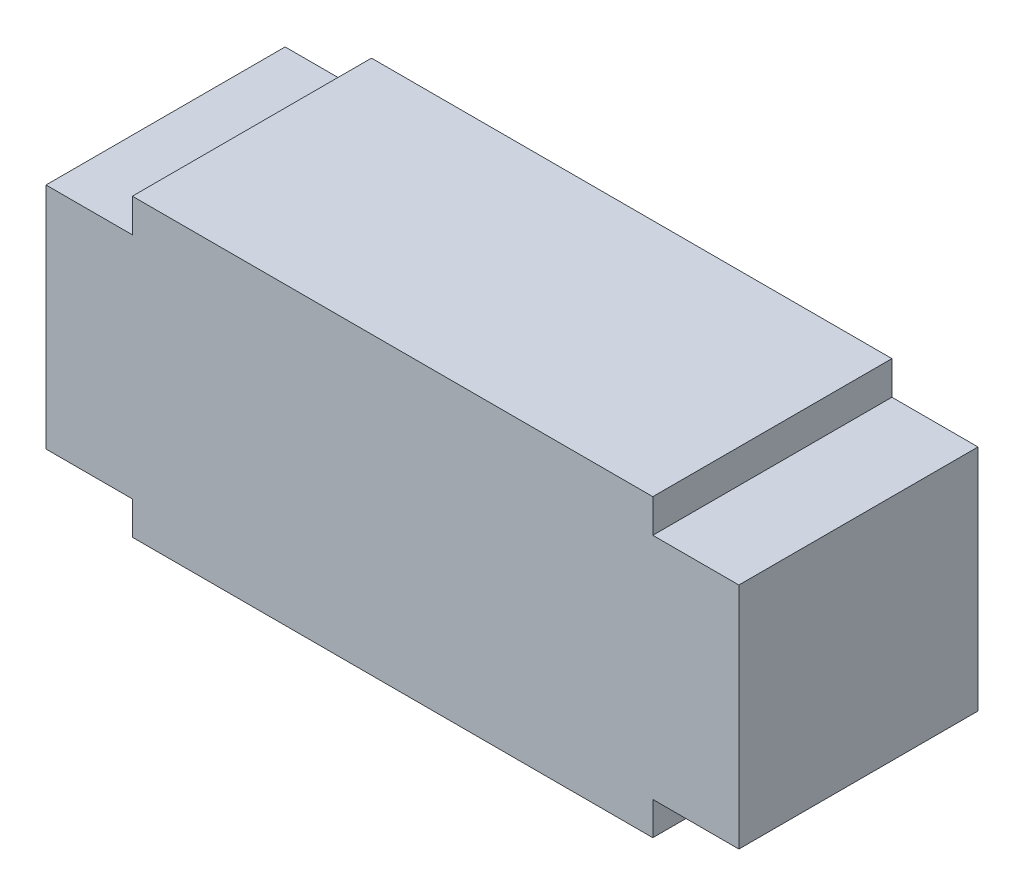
ISO-10303-21;
HEADER;
FILE_DESCRIPTION(('STEP AP214'),'2;1');
FILE_NAME('part.step','',(''),(''),'','','');
FILE_SCHEMA(('AUTOMOTIVE_DESIGN { 1 0 10303 214 1 1 1 1 }'));
ENDSEC;
DATA;
#1=APPLICATION_CONTEXT('core data for automotive mechanical design processes');
#2=APPLICATION_PROTOCOL_DEFINITION('international standard','automotive_design',2000,#1);
#3=PRODUCT_CONTEXT('',#1,'mechanical');
#4=PRODUCT('Part','Part','',(#3));
#5=PRODUCT_RELATED_PRODUCT_CATEGORY('part','',(#4));
#6=PRODUCT_DEFINITION_FORMATION('','',#4);
#7=PRODUCT_DEFINITION_CONTEXT('part definition',#1,'design');
#8=PRODUCT_DEFINITION('design','',#6,#7);
#9=PRODUCT_DEFINITION_SHAPE('','',#8);
#10=(LENGTH_UNIT() NAMED_UNIT(*) SI_UNIT(.MILLI.,.METRE.));
#11=(NAMED_UNIT(*) PLANE_ANGLE_UNIT() SI_UNIT($,.RADIAN.));
#12=(NAMED_UNIT(*) SI_UNIT($,.STERADIAN.) SOLID_ANGLE_UNIT());
#13=UNCERTAINTY_MEASURE_WITH_UNIT(LENGTH_MEASURE(1.E-05),#10,'distance_accuracy_value','');
#14=(GEOMETRIC_REPRESENTATION_CONTEXT(3) GLOBAL_UNCERTAINTY_ASSIGNED_CONTEXT((#13)) GLOBAL_UNIT_ASSIGNED_CONTEXT((#10,
#11,#12)) REPRESENTATION_CONTEXT('',''));
#15=CARTESIAN_POINT('',(0.,0.,0.));
#16=DIRECTION('',(0.,0.,1.));
#17=DIRECTION('',(1.,0.,0.));
#18=AXIS2_PLACEMENT_3D('',#15,#16,#17);
#19=CARTESIAN_POINT('',(0.,0.,0.849999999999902));
#20=DIRECTION('',(0.,0.,1.));
#21=DIRECTION('',(1.,0.,0.));
#22=AXIS2_PLACEMENT_3D('',#19,#20,#21);
#23=PLANE('',#22);
#24=DIRECTION('',(0.,1.,0.));
#25=VECTOR('',#24,1.);
#26=CARTESIAN_POINT('',(-0.92500000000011,0.,0.849999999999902));
#27=LINE('',#26,#25);
#28=CARTESIAN_POINT('',(-0.92500000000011,-0.406999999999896,0.849999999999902));
#29=VERTEX_POINT('',#28);
#30=CARTESIAN_POINT('',(-0.92500000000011,-0.524999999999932,0.849999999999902));
#31=VERTEX_POINT('',#30);
#32=EDGE_CURVE('E128',#29,#31,#27,.F.);
#33=ORIENTED_EDGE('',*,*,#32,.T.);
#34=DIRECTION('',(1.,0.,0.));
#35=VECTOR('',#34,1.);
#36=CARTESIAN_POINT('',(-0.92500000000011,-0.524999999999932,0.849999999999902));
#37=LINE('',#36,#35);
#38=CARTESIAN_POINT('',(0.92500000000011,-0.524999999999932,0.849999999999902));
#39=VERTEX_POINT('',#38);
#40=EDGE_CURVE('E130',#39,#31,#37,.F.);
#41=ORIENTED_EDGE('',*,*,#40,.F.);
#42=DIRECTION('',(0.,1.,0.));
#43=VECTOR('',#42,1.);
#44=CARTESIAN_POINT('',(0.92500000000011,-0.524999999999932,0.849999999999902));
#45=LINE('',#44,#43);
#46=CARTESIAN_POINT('',(0.92500000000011,-0.406999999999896,0.849999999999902));
#47=VERTEX_POINT('',#46);
#48=EDGE_CURVE('E133',#47,#39,#45,.F.);
#49=ORIENTED_EDGE('',*,*,#48,.F.);
#50=DIRECTION('',(1.,0.,0.));
#51=VECTOR('',#50,1.);
#52=CARTESIAN_POINT('',(0.92500000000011,-0.406999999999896,0.849999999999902));
#53=LINE('',#52,#51);
#54=CARTESIAN_POINT('',(1.2309999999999,-0.406999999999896,0.849999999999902));
#55=VERTEX_POINT('',#54);
#56=EDGE_CURVE('E137',#55,#47,#53,.F.);
#57=ORIENTED_EDGE('',*,*,#56,.F.);
#58=DIRECTION('',(0.,1.,0.));
#59=VECTOR('',#58,1.);
#60=CARTESIAN_POINT('',(1.2309999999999,-0.406999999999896,0.849999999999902));
#61=LINE('',#60,#59);
#62=CARTESIAN_POINT('',(1.2309999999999,0.4059999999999,0.849999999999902));
#63=VERTEX_POINT('',#62);
#64=EDGE_CURVE('E141',#63,#55,#61,.F.);
#65=ORIENTED_EDGE('',*,*,#64,.F.);
#66=DIRECTION('',(1.,0.,0.));
#67=VECTOR('',#66,1.);
#68=CARTESIAN_POINT('',(1.2309999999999,0.4059999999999,0.849999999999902));
#69=LINE('',#68,#67);
#70=CARTESIAN_POINT('',(0.92500000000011,0.4059999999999,0.849999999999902));
#71=VERTEX_POINT('',#70);
#72=EDGE_CURVE('E145',#71,#63,#69,.T.);
#73=ORIENTED_EDGE('',*,*,#72,.F.);
#74=DIRECTION('',(0.,1.,0.));
#75=VECTOR('',#74,1.);
#76=CARTESIAN_POINT('',(0.92500000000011,0.4059999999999,0.849999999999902));
#77=LINE('',#76,#75);
#78=CARTESIAN_POINT('',(0.92500000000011,0.524999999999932,0.849999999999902));
#79=VERTEX_POINT('',#78);
#80=EDGE_CURVE('E149',#79,#71,#77,.F.);
#81=ORIENTED_EDGE('',*,*,#80,.F.);
#82=DIRECTION('',(1.,0.,0.));
#83=VECTOR('',#82,1.);
#84=CARTESIAN_POINT('',(0.92500000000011,0.524999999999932,0.849999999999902));
#85=LINE('',#84,#83);
#86=CARTESIAN_POINT('',(-0.92500000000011,0.524999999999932,0.849999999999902));
#87=VERTEX_POINT('',#86);
#88=EDGE_CURVE('E107',#87,#79,#85,.T.);
#89=ORIENTED_EDGE('',*,*,#88,.F.);
#90=DIRECTION('',(0.,1.,0.));
#91=VECTOR('',#90,1.);
#92=CARTESIAN_POINT('',(-0.92500000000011,0.,0.849999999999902));
#93=LINE('',#92,#91);
#94=CARTESIAN_POINT('',(-0.92500000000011,0.4059999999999,0.849999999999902));
#95=VERTEX_POINT('',#94);
#96=EDGE_CURVE('E19',#87,#95,#93,.F.);
#97=ORIENTED_EDGE('',*,*,#96,.T.);
#98=DIRECTION('',(1.,0.,0.));
#99=VECTOR('',#98,1.);
#100=CARTESIAN_POINT('',(0.,0.4059999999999,0.849999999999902));
#101=LINE('',#100,#99);
#102=CARTESIAN_POINT('',(-1.2319999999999,0.4059999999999,0.849999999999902));
#103=VERTEX_POINT('',#102);
#104=EDGE_CURVE('E102',#95,#103,#101,.F.);
#105=ORIENTED_EDGE('',*,*,#104,.T.);
#106=DIRECTION('',(0.,1.,0.));
#107=VECTOR('',#106,1.);
#108=CARTESIAN_POINT('',(-1.2319999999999,0.,0.849999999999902));
#109=LINE('',#108,#107);
#110=CARTESIAN_POINT('',(-1.2319999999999,-0.406999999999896,0.849999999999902));
#111=VERTEX_POINT('',#110);
#112=EDGE_CURVE('E123',#103,#111,#109,.F.);
#113=ORIENTED_EDGE('',*,*,#112,.T.);
#114=DIRECTION('',(1.,0.,0.));
#115=VECTOR('',#114,1.);
#116=CARTESIAN_POINT('',(0.,-0.406999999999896,0.849999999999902));
#117=LINE('',#116,#115);
#118=EDGE_CURVE('E124',#111,#29,#117,.T.);
#119=ORIENTED_EDGE('',*,*,#118,.T.);
#120=EDGE_LOOP('',(#33,#41,#49,#57,#65,#73,#81,#89,#97,#105,#113,#119));
#121=FACE_BOUND('',#120,.T.);
#122=ADVANCED_FACE('F16',(#121),#23,.T.);
#123=CARTESIAN_POINT('',(-0.92500000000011,-0.524999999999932,0.));
#124=DIRECTION('',(0.,-1.,0.));
#125=DIRECTION('',(0.,0.,-1.));
#126=AXIS2_PLACEMENT_3D('',#123,#124,#125);
#127=PLANE('',#126);
#128=DIRECTION('',(0.,0.,1.));
#129=VECTOR('',#128,1.);
#130=CARTESIAN_POINT('',(-0.92500000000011,-0.524999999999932,0.));
#131=LINE('',#130,#129);
#132=CARTESIAN_POINT('',(-0.92500000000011,-0.524999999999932,0.));
#133=VERTEX_POINT('',#132);
#134=EDGE_CURVE('E160',#133,#31,#131,.T.);
#135=ORIENTED_EDGE('',*,*,#134,.F.);
#136=DIRECTION('',(1.,0.,0.));
#137=VECTOR('',#136,1.);
#138=CARTESIAN_POINT('',(0.,-0.524999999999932,0.));
#139=LINE('',#138,#137);
#140=CARTESIAN_POINT('',(0.92500000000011,-0.524999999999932,0.));
#141=VERTEX_POINT('',#140);
#142=EDGE_CURVE('E164',#133,#141,#139,.T.);
#143=ORIENTED_EDGE('',*,*,#142,.T.);
#144=DIRECTION('',(0.,0.,-1.));
#145=VECTOR('',#144,1.);
#146=CARTESIAN_POINT('',(0.92500000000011,-0.524999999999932,0.));
#147=LINE('',#146,#145);
#148=EDGE_CURVE('E135',#39,#141,#147,.T.);
#149=ORIENTED_EDGE('',*,*,#148,.F.);
#150=ORIENTED_EDGE('',*,*,#40,.T.);
#151=EDGE_LOOP('',(#135,#143,#149,#150));
#152=FACE_BOUND('',#151,.T.);
#153=ADVANCED_FACE('F207',(#152),#127,.T.);
#154=CARTESIAN_POINT('',(0.92500000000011,-0.524999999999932,0.));
#155=DIRECTION('',(1.,0.,0.));
#156=DIRECTION('',(0.,0.,-1.));
#157=AXIS2_PLACEMENT_3D('',#154,#155,#156);
#158=PLANE('',#157);
#159=ORIENTED_EDGE('',*,*,#148,.T.);
#160=DIRECTION('',(0.,1.,0.));
#161=VECTOR('',#160,1.);
#162=CARTESIAN_POINT('',(0.92500000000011,0.,0.));
#163=LINE('',#162,#161);
#164=CARTESIAN_POINT('',(0.92500000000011,-0.406999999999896,0.));
#165=VERTEX_POINT('',#164);
#166=EDGE_CURVE('E167',#141,#165,#163,.T.);
#167=ORIENTED_EDGE('',*,*,#166,.T.);
#168=DIRECTION('',(0.,0.,-1.));
#169=VECTOR('',#168,1.);
#170=CARTESIAN_POINT('',(0.92500000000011,-0.406999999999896,0.));
#171=LINE('',#170,#169);
#172=EDGE_CURVE('E139',#47,#165,#171,.T.);
#173=ORIENTED_EDGE('',*,*,#172,.F.);
#174=ORIENTED_EDGE('',*,*,#48,.T.);
#175=EDGE_LOOP('',(#159,#167,#173,#174));
#176=FACE_BOUND('',#175,.T.);
#177=ADVANCED_FACE('F244',(#176),#158,.T.);
#178=CARTESIAN_POINT('',(0.92500000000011,-0.406999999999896,0.));
#179=DIRECTION('',(0.,-1.,0.));
#180=DIRECTION('',(0.,0.,-1.));
#181=AXIS2_PLACEMENT_3D('',#178,#179,#180);
#182=PLANE('',#181);
#183=ORIENTED_EDGE('',*,*,#172,.T.);
#184=DIRECTION('',(1.,0.,0.));
#185=VECTOR('',#184,1.);
#186=CARTESIAN_POINT('',(0.,-0.406999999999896,0.));
#187=LINE('',#186,#185);
#188=CARTESIAN_POINT('',(1.2309999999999,-0.406999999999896,0.));
#189=VERTEX_POINT('',#188);
#190=EDGE_CURVE('E170',#165,#189,#187,.T.);
#191=ORIENTED_EDGE('',*,*,#190,.T.);
#192=DIRECTION('',(0.,0.,-1.));
#193=VECTOR('',#192,1.);
#194=CARTESIAN_POINT('',(1.2309999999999,-0.406999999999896,0.));
#195=LINE('',#194,#193);
#196=EDGE_CURVE('E143',#55,#189,#195,.T.);
#197=ORIENTED_EDGE('',*,*,#196,.F.);
#198=ORIENTED_EDGE('',*,*,#56,.T.);
#199=EDGE_LOOP('',(#183,#191,#197,#198));
#200=FACE_BOUND('',#199,.T.);
#201=ADVANCED_FACE('F240',(#200),#182,.T.);
#202=CARTESIAN_POINT('',(1.2309999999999,-0.406999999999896,0.));
#203=DIRECTION('',(1.,0.,0.));
#204=DIRECTION('',(0.,0.,-1.));
#205=AXIS2_PLACEMENT_3D('',#202,#203,#204);
#206=PLANE('',#205);
#207=ORIENTED_EDGE('',*,*,#196,.T.);
#208=DIRECTION('',(0.,1.,0.));
#209=VECTOR('',#208,1.);
#210=CARTESIAN_POINT('',(1.2309999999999,0.,0.));
#211=LINE('',#210,#209);
#212=CARTESIAN_POINT('',(1.2309999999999,0.4059999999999,0.));
#213=VERTEX_POINT('',#212);
#214=EDGE_CURVE('E173',#189,#213,#211,.T.);
#215=ORIENTED_EDGE('',*,*,#214,.T.);
#216=DIRECTION('',(0.,0.,1.));
#217=VECTOR('',#216,1.);
#218=CARTESIAN_POINT('',(1.2309999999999,0.4059999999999,0.));
#219=LINE('',#218,#217);
#220=EDGE_CURVE('E147',#63,#213,#219,.F.);
#221=ORIENTED_EDGE('',*,*,#220,.F.);
#222=ORIENTED_EDGE('',*,*,#64,.T.);
#223=EDGE_LOOP('',(#207,#215,#221,#222));
#224=FACE_BOUND('',#223,.T.);
#225=ADVANCED_FACE('F236',(#224),#206,.T.);
#226=CARTESIAN_POINT('',(1.2309999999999,0.4059999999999,0.));
#227=DIRECTION('',(0.,1.,0.));
#228=DIRECTION('',(0.,0.,1.));
#229=AXIS2_PLACEMENT_3D('',#226,#227,#228);
#230=PLANE('',#229);
#231=ORIENTED_EDGE('',*,*,#220,.T.);
#232=DIRECTION('',(1.,0.,0.));
#233=VECTOR('',#232,1.);
#234=CARTESIAN_POINT('',(0.,0.4059999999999,0.));
#235=LINE('',#234,#233);
#236=CARTESIAN_POINT('',(0.92500000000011,0.4059999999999,0.));
#237=VERTEX_POINT('',#236);
#238=EDGE_CURVE('E176',#213,#237,#235,.F.);
#239=ORIENTED_EDGE('',*,*,#238,.T.);
#240=DIRECTION('',(0.,0.,-1.));
#241=VECTOR('',#240,1.);
#242=CARTESIAN_POINT('',(0.92500000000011,0.4059999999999,0.));
#243=LINE('',#242,#241);
#244=EDGE_CURVE('E151',#71,#237,#243,.T.);
#245=ORIENTED_EDGE('',*,*,#244,.F.);
#246=ORIENTED_EDGE('',*,*,#72,.T.);
#247=EDGE_LOOP('',(#231,#239,#245,#246));
#248=FACE_BOUND('',#247,.T.);
#249=ADVANCED_FACE('F232',(#248),#230,.T.);
#250=CARTESIAN_POINT('',(0.92500000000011,0.4059999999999,0.));
#251=DIRECTION('',(1.,0.,0.));
#252=DIRECTION('',(0.,0.,-1.));
#253=AXIS2_PLACEMENT_3D('',#250,#251,#252);
#254=PLANE('',#253);
#255=ORIENTED_EDGE('',*,*,#244,.T.);
#256=DIRECTION('',(0.,1.,0.));
#257=VECTOR('',#256,1.);
#258=CARTESIAN_POINT('',(0.92500000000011,0.,0.));
#259=LINE('',#258,#257);
#260=CARTESIAN_POINT('',(0.92500000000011,0.524999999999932,0.));
#261=VERTEX_POINT('',#260);
#262=EDGE_CURVE('E179',#237,#261,#259,.T.);
#263=ORIENTED_EDGE('',*,*,#262,.T.);
#264=DIRECTION('',(0.,0.,1.));
#265=VECTOR('',#264,1.);
#266=CARTESIAN_POINT('',(0.92500000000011,0.524999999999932,0.));
#267=LINE('',#266,#265);
#268=EDGE_CURVE('E154',#79,#261,#267,.F.);
#269=ORIENTED_EDGE('',*,*,#268,.F.);
#270=ORIENTED_EDGE('',*,*,#80,.T.);
#271=EDGE_LOOP('',(#255,#263,#269,#270));
#272=FACE_BOUND('',#271,.T.);
#273=ADVANCED_FACE('F228',(#272),#254,.T.);
#274=CARTESIAN_POINT('',(0.92500000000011,0.524999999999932,0.));
#275=DIRECTION('',(0.,1.,0.));
#276=DIRECTION('',(0.,0.,1.));
#277=AXIS2_PLACEMENT_3D('',#274,#275,#276);
#278=PLANE('',#277);
#279=ORIENTED_EDGE('',*,*,#268,.T.);
#280=DIRECTION('',(1.,0.,0.));
#281=VECTOR('',#280,1.);
#282=CARTESIAN_POINT('',(0.,0.524999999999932,0.));
#283=LINE('',#282,#281);
#284=CARTESIAN_POINT('',(-0.92500000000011,0.524999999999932,0.));
#285=VERTEX_POINT('',#284);
#286=EDGE_CURVE('E182',#261,#285,#283,.F.);
#287=ORIENTED_EDGE('',*,*,#286,.T.);
#288=DIRECTION('',(0.,0.,1.));
#289=VECTOR('',#288,1.);
#290=CARTESIAN_POINT('',(-0.92500000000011,0.524999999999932,0.));
#291=LINE('',#290,#289);
#292=EDGE_CURVE('E119',#87,#285,#291,.F.);
#293=ORIENTED_EDGE('',*,*,#292,.F.);
#294=ORIENTED_EDGE('',*,*,#88,.T.);
#295=EDGE_LOOP('',(#279,#287,#293,#294));
#296=FACE_BOUND('',#295,.T.);
#297=ADVANCED_FACE('F225',(#296),#278,.T.);
#298=CARTESIAN_POINT('',(-0.92500000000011,0.524999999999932,0.));
#299=DIRECTION('',(-1.,0.,0.));
#300=DIRECTION('',(0.,0.,1.));
#301=AXIS2_PLACEMENT_3D('',#298,#299,#300);
#302=PLANE('',#301);
#303=ORIENTED_EDGE('',*,*,#292,.T.);
#304=DIRECTION('',(0.,1.,0.));
#305=VECTOR('',#304,1.);
#306=CARTESIAN_POINT('',(-0.92500000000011,0.,0.));
#307=LINE('',#306,#305);
#308=CARTESIAN_POINT('',(-0.92500000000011,0.4059999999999,0.));
#309=VERTEX_POINT('',#308);
#310=EDGE_CURVE('E114',#285,#309,#307,.F.);
#311=ORIENTED_EDGE('',*,*,#310,.T.);
#312=DIRECTION('',(0.,0.,1.));
#313=VECTOR('',#312,1.);
#314=CARTESIAN_POINT('',(-0.92500000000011,0.4059999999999,0.));
#315=LINE('',#314,#313);
#316=EDGE_CURVE('E111',#95,#309,#315,.F.);
#317=ORIENTED_EDGE('',*,*,#316,.F.);
#318=ORIENTED_EDGE('',*,*,#96,.F.);
#319=EDGE_LOOP('',(#303,#311,#317,#318));
#320=FACE_BOUND('',#319,.T.);
#321=ADVANCED_FACE('F112',(#320),#302,.T.);
#322=CARTESIAN_POINT('',(-0.92500000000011,0.4059999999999,0.));
#323=DIRECTION('',(0.,1.,0.));
#324=DIRECTION('',(0.,0.,1.));
#325=AXIS2_PLACEMENT_3D('',#322,#323,#324);
#326=PLANE('',#325);
#327=ORIENTED_EDGE('',*,*,#316,.T.);
#328=DIRECTION('',(1.,0.,0.));
#329=VECTOR('',#328,1.);
#330=CARTESIAN_POINT('',(0.,0.4059999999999,0.));
#331=LINE('',#330,#329);
#332=CARTESIAN_POINT('',(-1.2319999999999,0.4059999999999,0.));
#333=VERTEX_POINT('',#332);
#334=EDGE_CURVE('E186',#309,#333,#331,.F.);
#335=ORIENTED_EDGE('',*,*,#334,.T.);
#336=DIRECTION('',(0.,0.,1.));
#337=VECTOR('',#336,1.);
#338=CARTESIAN_POINT('',(-1.2319999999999,0.4059999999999,0.));
#339=LINE('',#338,#337);
#340=EDGE_CURVE('E118',#103,#333,#339,.F.);
#341=ORIENTED_EDGE('',*,*,#340,.F.);
#342=ORIENTED_EDGE('',*,*,#104,.F.);
#343=EDGE_LOOP('',(#327,#335,#341,#342));
#344=FACE_BOUND('',#343,.T.);
#345=ADVANCED_FACE('F121',(#344),#326,.T.);
#346=CARTESIAN_POINT('',(-1.2319999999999,0.4059999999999,0.));
#347=DIRECTION('',(-1.,0.,0.));
#348=DIRECTION('',(0.,0.,1.));
#349=AXIS2_PLACEMENT_3D('',#346,#347,#348);
#350=PLANE('',#349);
#351=ORIENTED_EDGE('',*,*,#340,.T.);
#352=DIRECTION('',(0.,1.,0.));
#353=VECTOR('',#352,1.);
#354=CARTESIAN_POINT('',(-1.2319999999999,0.,0.));
#355=LINE('',#354,#353);
#356=CARTESIAN_POINT('',(-1.2319999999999,-0.406999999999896,0.));
#357=VERTEX_POINT('',#356);
#358=EDGE_CURVE('E188',#333,#357,#355,.F.);
#359=ORIENTED_EDGE('',*,*,#358,.T.);
#360=DIRECTION('',(0.,0.,-1.));
#361=VECTOR('',#360,1.);
#362=CARTESIAN_POINT('',(-1.2319999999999,-0.406999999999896,0.));
#363=LINE('',#362,#361);
#364=EDGE_CURVE('E158',#111,#357,#363,.T.);
#365=ORIENTED_EDGE('',*,*,#364,.F.);
#366=ORIENTED_EDGE('',*,*,#112,.F.);
#367=EDGE_LOOP('',(#351,#359,#365,#366));
#368=FACE_BOUND('',#367,.T.);
#369=ADVANCED_FACE('F201',(#368),#350,.T.);
#370=CARTESIAN_POINT('',(-1.2319999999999,-0.406999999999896,0.));
#371=DIRECTION('',(0.,-1.,0.));
#372=DIRECTION('',(0.,0.,-1.));
#373=AXIS2_PLACEMENT_3D('',#370,#371,#372);
#374=PLANE('',#373);
#375=ORIENTED_EDGE('',*,*,#364,.T.);
#376=DIRECTION('',(1.,0.,0.));
#377=VECTOR('',#376,1.);
#378=CARTESIAN_POINT('',(0.,-0.406999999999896,0.));
#379=LINE('',#378,#377);
#380=CARTESIAN_POINT('',(-0.92500000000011,-0.406999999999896,0.));
#381=VERTEX_POINT('',#380);
#382=EDGE_CURVE('E25',#357,#381,#379,.T.);
#383=ORIENTED_EDGE('',*,*,#382,.T.);
#384=DIRECTION('',(0.,0.,1.));
#385=VECTOR('',#384,1.);
#386=CARTESIAN_POINT('',(-0.92500000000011,-0.406999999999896,0.));
#387=LINE('',#386,#385);
#388=EDGE_CURVE('E33',#29,#381,#387,.F.);
#389=ORIENTED_EDGE('',*,*,#388,.F.);
#390=ORIENTED_EDGE('',*,*,#118,.F.);
#391=EDGE_LOOP('',(#375,#383,#389,#390));
#392=FACE_BOUND('',#391,.T.);
#393=ADVANCED_FACE('F194',(#392),#374,.T.);
#394=CARTESIAN_POINT('',(-0.92500000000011,-0.406999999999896,0.));
#395=DIRECTION('',(-1.,0.,0.));
#396=DIRECTION('',(0.,0.,1.));
#397=AXIS2_PLACEMENT_3D('',#394,#395,#396);
#398=PLANE('',#397);
#399=ORIENTED_EDGE('',*,*,#388,.T.);
#400=DIRECTION('',(0.,1.,0.));
#401=VECTOR('',#400,1.);
#402=CARTESIAN_POINT('',(-0.92500000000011,0.,0.));
#403=LINE('',#402,#401);
#404=EDGE_CURVE('E11',#381,#133,#403,.F.);
#405=ORIENTED_EDGE('',*,*,#404,.T.);
#406=ORIENTED_EDGE('',*,*,#134,.T.);
#407=ORIENTED_EDGE('',*,*,#32,.F.);
#408=EDGE_LOOP('',(#399,#405,#406,#407));
#409=FACE_BOUND('',#408,.T.);
#410=ADVANCED_FACE('F208',(#409),#398,.T.);
#411=CARTESIAN_POINT('',(0.,0.,0.));
#412=DIRECTION('',(0.,0.,1.));
#413=DIRECTION('',(1.,0.,0.));
#414=AXIS2_PLACEMENT_3D('',#411,#412,#413);
#415=PLANE('',#414);
#416=ORIENTED_EDGE('',*,*,#382,.F.);
#417=ORIENTED_EDGE('',*,*,#358,.F.);
#418=ORIENTED_EDGE('',*,*,#334,.F.);
#419=ORIENTED_EDGE('',*,*,#310,.F.);
#420=ORIENTED_EDGE('',*,*,#286,.F.);
#421=ORIENTED_EDGE('',*,*,#262,.F.);
#422=ORIENTED_EDGE('',*,*,#238,.F.);
#423=ORIENTED_EDGE('',*,*,#214,.F.);
#424=ORIENTED_EDGE('',*,*,#190,.F.);
#425=ORIENTED_EDGE('',*,*,#166,.F.);
#426=ORIENTED_EDGE('',*,*,#142,.F.);
#427=ORIENTED_EDGE('',*,*,#404,.F.);
#428=EDGE_LOOP('',(#416,#417,#418,#419,#420,#421,#422,#423,#424,#425,#426,#427));
#429=FACE_BOUND('',#428,.T.);
#430=ADVANCED_FACE('F199',(#429),#415,.F.);
#431=CLOSED_SHELL('',(#122,#153,#177,#201,#225,#249,#273,#297,#321,#345,#369,#393,#410,#430));
#432=MANIFOLD_SOLID_BREP('B1',#431);
#433=ADVANCED_BREP_SHAPE_REPRESENTATION('',(#18,#432),#14);
#434=SHAPE_DEFINITION_REPRESENTATION(#9,#433);
ENDSEC;
END-ISO-10303-21;
